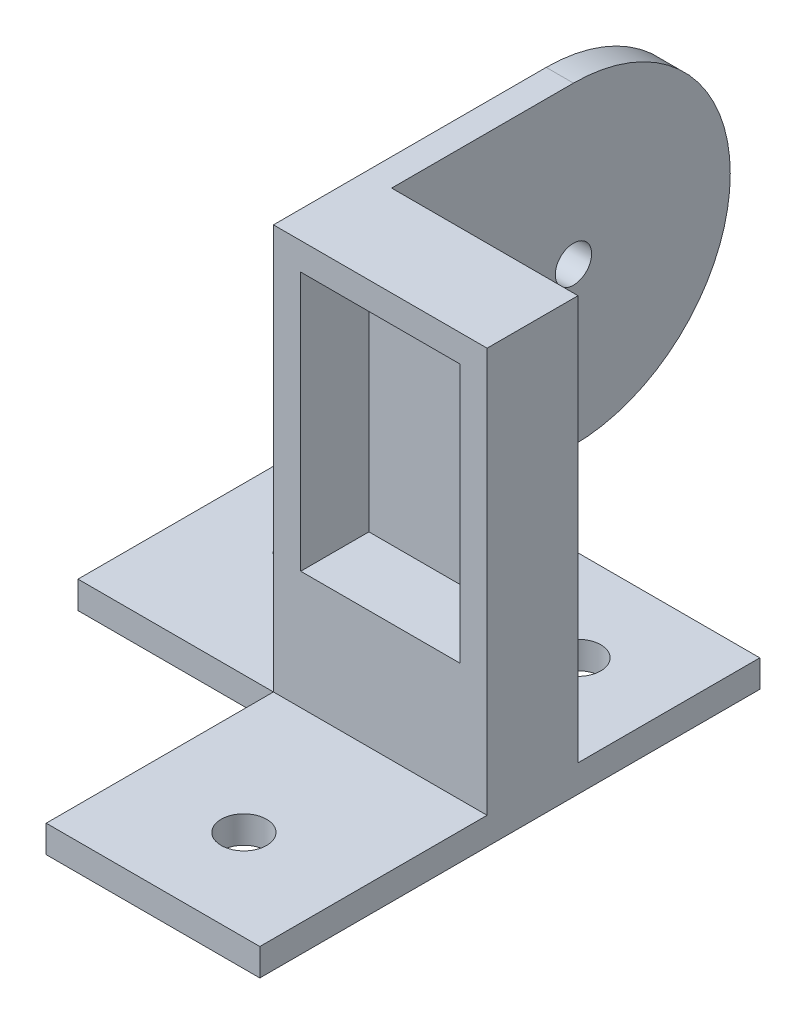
from build123d import *

# Parameters (mm, degrees)
CROQUIS1_W              = 23.5
CROQUIS1_H              = 34.5
CROQUIS1_W_2            = 17.5
CROQUIS1_H_2            = 28.5
SALIENTE_EXTRUIR1_DEPTH = 10
CROQUIS2_R              = 2
SALIENTE_EXTRUIR2_DEPTH = 3
SALIENTE_EXTRUIR3_DEPTH = 10
CROQUIS4_W              = 20.5
CROQUIS4_H              = 20
SALIENTE_EXTRUIR4_DEPTH = 3
CROQUIS5_R              = 2.5
CORTAR_EXTRUIR1_DEPTH   = 3
CROQUIS6_W              = 17.5
CROQUIS6_H              = 28.5
SALIENTE_EXTRUIR5_DEPTH = 2.5


with BuildPart() as part:
    # Croquis1 → Saliente-Extruir1 (new body)
    with BuildSketch(Plane.XY):
        with Locations((0, 0.25)):
            Rectangle(CROQUIS1_W, CROQUIS1_H)
        with Locations((0, 0.25)):
            Rectangle(CROQUIS1_W_2, CROQUIS1_H_2, mode=Mode.SUBTRACT)
    extrude(amount=SALIENTE_EXTRUIR1_DEPTH)

    # Croquis2 → Saliente-Extruir2 (add)
    with BuildSketch(Plane.ZY.offset(11.75)):
        with BuildLine():
            Line((0, 17.5), (-20, 17.5))
            ThreePointArc((-20, 17.5), (-37.25, 0.25), (-20, -17))
            Line((-20, -17), (0, -17))
            Line((0, -17), (0, 17.5))
        make_face()
        with Locations(Location((-20, 0.25, 0), (0, 0, 270))):
            Circle(CROQUIS2_R, mode=Mode.SUBTRACT)
    extrude(amount=-SALIENTE_EXTRUIR2_DEPTH)

    # Croquis3 → Saliente-Extruir3 (add)
    with BuildSketch(Plane.XZ.offset(17)):
        Polygon((-11.75, 10), (-11.75, -20), (-8.75, -20), (-8.75, 0), (11.75, 0), (11.75, 10), align=None)
    extrude(amount=SALIENTE_EXTRUIR3_DEPTH)

    # Croquis4 → Saliente-Extruir4 (add)
    with BuildSketch(Plane.XZ.offset(27)):
        Polygon((-33.25, -20), (-11.75, -20), (-11.75, 10), (-11.75, 10.000803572), (-33.25, 10.000803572), align=None)
        with Locations((1.5, -10)):
            Rectangle(CROQUIS4_W, CROQUIS4_H)
        Polygon((-11.75, 10.000803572), (-11.75, 10), (11.75, 10), (11.75, 35), (-11.75, 35), align=None)
        Polygon((11.75, 0), (11.75, 10), (-11.75, 10), (-11.75, -20), (-8.75, -20), (-8.75, 0), align=None)
    extrude(amount=SALIENTE_EXTRUIR4_DEPTH)

    # Croquis5 → Cortar-Extruir1 (cut)
    with BuildSketch(Plane.XZ.offset(30)):
        with Locations(Location((-23.25, -4.999196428, 0), (0, 0, 270))):
            Circle(CROQUIS5_R)
        with Locations(Location((1.75, -10, 0), (0, 0, 270))):
            Circle(CROQUIS5_R)
        with Locations(Location((0, 25, 0), (0, 0, 270))):
            Circle(CROQUIS5_R)
    extrude(amount=-CORTAR_EXTRUIR1_DEPTH, mode=Mode.SUBTRACT)

    # Croquis6 → Saliente-Extruir5 (add)
    with BuildSketch(Plane(origin=(0, 0, 0), x_dir=(-1, 0, 0), z_dir=(0, 0, -1))):
        with Locations((0, 0.25)):
            Rectangle(CROQUIS6_W, CROQUIS6_H)
    extrude(amount=-SALIENTE_EXTRUIR5_DEPTH)


solid = part.part
